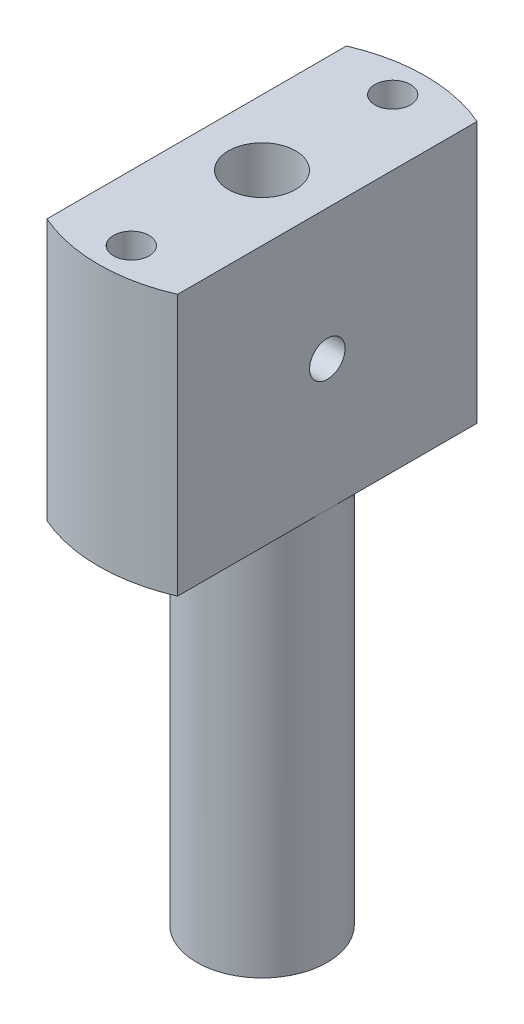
from build123d import *

# Parameters (mm, degrees)
SKETCH1_R                    = 6.35
BOSS_EXTRUDE1_DEPTH          = 38.1
SKETCH12_R                   = 15.875
BOSS_EXTRUDE4_DEPTH          = 25.4
F_0_257_DIAMETER_HOLE2_D     = 6.5278
F_0_257_DIAMETER_HOLE2_DEPTH = 50.8
F_0_257_DIAMETER_HOLE2_TIP   = 1.961148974
F_8_32_TAPPED_HOLE2_D        = 3.4544
SKETCH22_W                   = 10.375000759
SKETCH22_H                   = 34.343524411
SKETCH22_W_2                 = 11.541241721
CUT_EXTRUDE1_DEPTH           = 76.295235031
F_8_32_TAPPED_HOLE3_REACH    = 72.796
F_8_32_TAPPED_HOLE3_BORE_R   = 1.7272


with BuildPart() as part:
    # Sketch1 → Boss-Extrude1 (new body)
    with BuildSketch(Plane(origin=(0, 0, 0), x_dir=(1, 0, 0), z_dir=(0, 1, 0))):
        with Locations(Location((-12.73550872, 12.73550872, 0), (0, 0, 90))):
            Circle(SKETCH1_R)
    extrude(amount=BOSS_EXTRUDE1_DEPTH)

    # Sketch12 → Boss-Extrude4 (add)
    with BuildSketch(Plane(origin=(0, 38.1, 0), x_dir=(1, 0, 0), z_dir=(0, 1, 0))):
        with Locations(Location((-12.73550872, 12.73550872, 0), (0, 0, 270))):
            Circle(SKETCH12_R)
    extrude(amount=BOSS_EXTRUDE4_DEPTH)

    # F _0.257_ Diameter Hole2
    with Locations(Plane(origin=(0, 63.5, 0), x_dir=(1, 0, 0), z_dir=(0, 1, 0))):
        with Locations((-12.73550872, 12.73550872)):
            Hole(F_0_257_DIAMETER_HOLE2_D / 2, depth=F_0_257_DIAMETER_HOLE2_DEPTH)
            with Locations((0, 0, -(F_0_257_DIAMETER_HOLE2_DEPTH + F_0_257_DIAMETER_HOLE2_TIP / 2))):  # 118° drill point
                Cone(0, F_0_257_DIAMETER_HOLE2_D / 2, F_0_257_DIAMETER_HOLE2_TIP, mode=Mode.SUBTRACT)

    # 8-32 Tapped Hole2 (through all)
    with Locations(Plane(origin=(0, 63.5, 0), x_dir=(1, 0, 0), z_dir=(0, 1, 0))):
        with Locations((-12.73550872, 25.43550872), (-12.73550872, 0.03550872)):
            Hole(F_8_32_TAPPED_HOLE2_D / 2)

    # Sketch22 → Cut-Extrude1 (cut, through all)
    with BuildSketch(Plane(origin=(0, 63.5, 0), x_dir=(1, 0, 0), z_dir=(0, 1, 0))):
        with Locations((-24.2730091, 12.110736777)):
            Rectangle(SKETCH22_W, SKETCH22_H)
        with Locations((-0.61488786, 12.110736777)):
            Rectangle(SKETCH22_W_2, SKETCH22_H)
    extrude(amount=-CUT_EXTRUDE1_DEPTH, mode=Mode.SUBTRACT)

    # 8-32 Tapped Hole3 bore → 8-32 Tapped Hole3 (cut, up to next)
    with BuildSketch(Plane(origin=(-6.38550872, 0, 0), x_dir=(0, 0, -1), z_dir=(1, 0, 0)), mode=Mode.PRIVATE) as f_8_32_tapped_hole3_sk1:
        with Locations((12.73550872, 50.8)):
            Circle(F_8_32_TAPPED_HOLE3_BORE_R)
    f_8_32_tapped_hole3_tool1 = extrude(f_8_32_tapped_hole3_sk1.sketch, amount=-F_8_32_TAPPED_HOLE3_REACH, mode=Mode.PRIVATE) & part.part
    add(f_8_32_tapped_hole3_tool1.solids().sort_by_distance((-6.385509, 50.8, -12.735509))[0], mode=Mode.SUBTRACT)


solid = part.part
